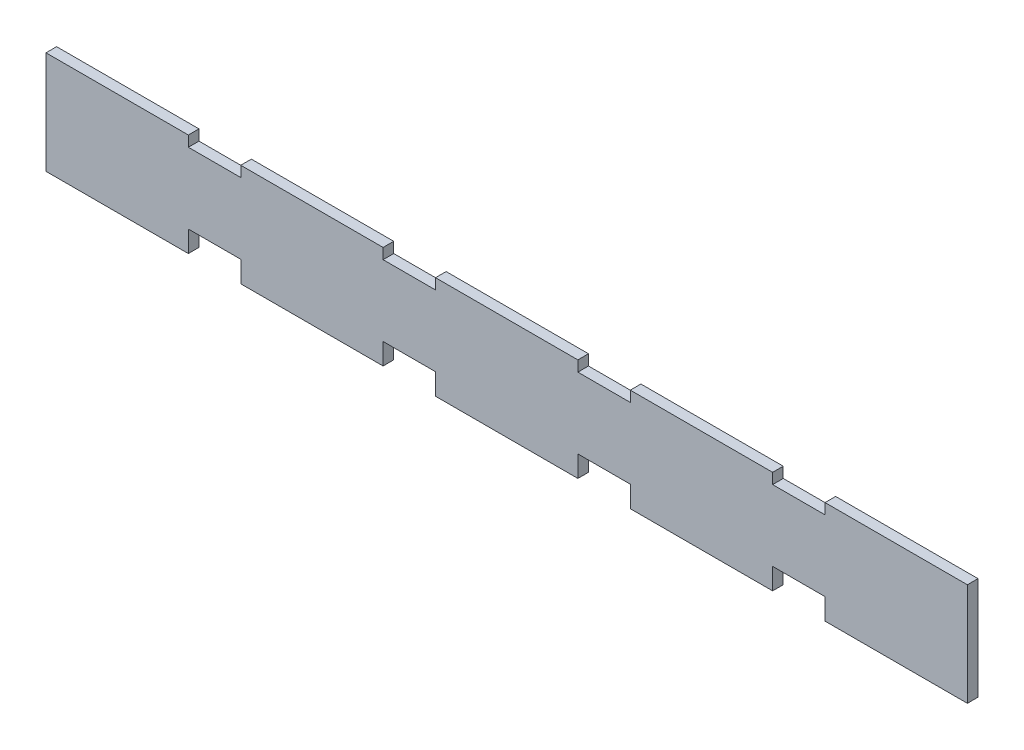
ISO-10303-21;
HEADER;
FILE_DESCRIPTION(('STEP AP214'),'2;1');
FILE_NAME('part.step','',(''),(''),'','','');
FILE_SCHEMA(('AUTOMOTIVE_DESIGN { 1 0 10303 214 1 1 1 1 }'));
ENDSEC;
DATA;
#1=APPLICATION_CONTEXT('core data for automotive mechanical design processes');
#2=APPLICATION_PROTOCOL_DEFINITION('international standard','automotive_design',2000,#1);
#3=PRODUCT_CONTEXT('',#1,'mechanical');
#4=PRODUCT('Part','Part','',(#3));
#5=PRODUCT_RELATED_PRODUCT_CATEGORY('part','',(#4));
#6=PRODUCT_DEFINITION_FORMATION('','',#4);
#7=PRODUCT_DEFINITION_CONTEXT('part definition',#1,'design');
#8=PRODUCT_DEFINITION('design','',#6,#7);
#9=PRODUCT_DEFINITION_SHAPE('','',#8);
#10=(LENGTH_UNIT() NAMED_UNIT(*) SI_UNIT(.MILLI.,.METRE.));
#11=(NAMED_UNIT(*) PLANE_ANGLE_UNIT() SI_UNIT($,.RADIAN.));
#12=(NAMED_UNIT(*) SI_UNIT($,.STERADIAN.) SOLID_ANGLE_UNIT());
#13=UNCERTAINTY_MEASURE_WITH_UNIT(LENGTH_MEASURE(1.E-05),#10,'distance_accuracy_value','');
#14=(GEOMETRIC_REPRESENTATION_CONTEXT(3) GLOBAL_UNCERTAINTY_ASSIGNED_CONTEXT((#13)) GLOBAL_UNIT_ASSIGNED_CONTEXT((#10,
#11,#12)) REPRESENTATION_CONTEXT('',''));
#15=CARTESIAN_POINT('',(0.,0.,0.));
#16=DIRECTION('',(0.,0.,1.));
#17=DIRECTION('',(1.,0.,0.));
#18=AXIS2_PLACEMENT_3D('',#15,#16,#17);
#19=CARTESIAN_POINT('',(-130.1,-10.,3.));
#20=DIRECTION('',(1.,0.,0.));
#21=DIRECTION('',(0.,1.,0.));
#22=AXIS2_PLACEMENT_3D('',#19,#20,#21);
#23=PLANE('',#22);
#24=DIRECTION('',(0.,-1.,0.));
#25=VECTOR('',#24,1.);
#26=CARTESIAN_POINT('',(-130.1,-10.,0.));
#27=LINE('',#26,#25);
#28=CARTESIAN_POINT('',(-130.1,13.,0.));
#29=VERTEX_POINT('',#28);
#30=CARTESIAN_POINT('',(-130.1,-16.,0.));
#31=VERTEX_POINT('',#30);
#32=EDGE_CURVE('E182',#29,#31,#27,.T.);
#33=ORIENTED_EDGE('',*,*,#32,.T.);
#34=DIRECTION('',(0.,0.,-1.));
#35=VECTOR('',#34,1.);
#36=CARTESIAN_POINT('',(-130.1,-16.,3.));
#37=LINE('',#36,#35);
#38=CARTESIAN_POINT('',(-130.1,-16.,3.));
#39=VERTEX_POINT('',#38);
#40=EDGE_CURVE('E11',#39,#31,#37,.T.);
#41=ORIENTED_EDGE('',*,*,#40,.F.);
#42=DIRECTION('',(0.,-1.,0.));
#43=VECTOR('',#42,1.);
#44=CARTESIAN_POINT('',(-130.1,9.99999999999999,3.));
#45=LINE('',#44,#43);
#46=CARTESIAN_POINT('',(-130.1,13.,3.));
#47=VERTEX_POINT('',#46);
#48=EDGE_CURVE('E188',#47,#39,#45,.T.);
#49=ORIENTED_EDGE('',*,*,#48,.F.);
#50=DIRECTION('',(0.,0.,-1.));
#51=VECTOR('',#50,1.);
#52=CARTESIAN_POINT('',(-130.1,13.,3.));
#53=LINE('',#52,#51);
#54=EDGE_CURVE('E310',#47,#29,#53,.T.);
#55=ORIENTED_EDGE('',*,*,#54,.T.);
#56=EDGE_LOOP('',(#33,#41,#49,#55));
#57=FACE_BOUND('',#56,.T.);
#58=ADVANCED_FACE('F45',(#57),#23,.F.);
#59=CARTESIAN_POINT('',(-130.1,-16.,3.));
#60=DIRECTION('',(0.,1.,0.));
#61=DIRECTION('',(0.,0.,1.));
#62=AXIS2_PLACEMENT_3D('',#59,#60,#61);
#63=PLANE('',#62);
#64=DIRECTION('',(1.,0.,0.));
#65=VECTOR('',#64,1.);
#66=CARTESIAN_POINT('',(-130.1,-16.,0.));
#67=LINE('',#66,#65);
#68=CARTESIAN_POINT('',(-89.9,-16.,0.));
#69=VERTEX_POINT('',#68);
#70=EDGE_CURVE('E316',#31,#69,#67,.T.);
#71=ORIENTED_EDGE('',*,*,#70,.T.);
#72=DIRECTION('',(0.,0.,-1.));
#73=VECTOR('',#72,1.);
#74=CARTESIAN_POINT('',(-89.9,-16.,3.));
#75=LINE('',#74,#73);
#76=CARTESIAN_POINT('',(-89.9,-16.,3.));
#77=VERTEX_POINT('',#76);
#78=EDGE_CURVE('E54',#77,#69,#75,.T.);
#79=ORIENTED_EDGE('',*,*,#78,.F.);
#80=DIRECTION('',(1.,0.,0.));
#81=VECTOR('',#80,1.);
#82=CARTESIAN_POINT('',(-130.1,-16.,3.));
#83=LINE('',#82,#81);
#84=EDGE_CURVE('E673',#39,#77,#83,.T.);
#85=ORIENTED_EDGE('',*,*,#84,.F.);
#86=ORIENTED_EDGE('',*,*,#40,.T.);
#87=EDGE_LOOP('',(#71,#79,#85,#86));
#88=FACE_BOUND('',#87,.T.);
#89=ADVANCED_FACE('F678',(#88),#63,.F.);
#90=CARTESIAN_POINT('',(-89.9,-10.,3.));
#91=DIRECTION('',(-1.,0.,0.));
#92=DIRECTION('',(0.,0.,1.));
#93=AXIS2_PLACEMENT_3D('',#90,#91,#92);
#94=PLANE('',#93);
#95=DIRECTION('',(0.,1.,0.));
#96=VECTOR('',#95,1.);
#97=CARTESIAN_POINT('',(-89.9,-10.,0.));
#98=LINE('',#97,#96);
#99=CARTESIAN_POINT('',(-89.9,-10.,0.));
#100=VERTEX_POINT('',#99);
#101=EDGE_CURVE('E319',#69,#100,#98,.T.);
#102=ORIENTED_EDGE('',*,*,#101,.T.);
#103=DIRECTION('',(0.,0.,-1.));
#104=VECTOR('',#103,1.);
#105=CARTESIAN_POINT('',(-89.9,-10.,3.));
#106=LINE('',#105,#104);
#107=CARTESIAN_POINT('',(-89.9,-10.,3.));
#108=VERTEX_POINT('',#107);
#109=EDGE_CURVE('E543',#108,#100,#106,.T.);
#110=ORIENTED_EDGE('',*,*,#109,.F.);
#111=DIRECTION('',(0.,1.,0.));
#112=VECTOR('',#111,1.);
#113=CARTESIAN_POINT('',(-89.9,-10.,3.));
#114=LINE('',#113,#112);
#115=EDGE_CURVE('E554',#77,#108,#114,.T.);
#116=ORIENTED_EDGE('',*,*,#115,.F.);
#117=ORIENTED_EDGE('',*,*,#78,.T.);
#118=EDGE_LOOP('',(#102,#110,#116,#117));
#119=FACE_BOUND('',#118,.T.);
#120=ADVANCED_FACE('F552',(#119),#94,.F.);
#121=CARTESIAN_POINT('',(-75.1,-10.,3.));
#122=DIRECTION('',(0.,1.,0.));
#123=DIRECTION('',(-1.,0.,0.));
#124=AXIS2_PLACEMENT_3D('',#121,#122,#123);
#125=PLANE('',#124);
#126=DIRECTION('',(1.,0.,0.));
#127=VECTOR('',#126,1.);
#128=CARTESIAN_POINT('',(-75.1,-10.,0.));
#129=LINE('',#128,#127);
#130=CARTESIAN_POINT('',(-75.1,-10.,0.));
#131=VERTEX_POINT('',#130);
#132=EDGE_CURVE('E322',#100,#131,#129,.T.);
#133=ORIENTED_EDGE('',*,*,#132,.T.);
#134=DIRECTION('',(0.,0.,-1.));
#135=VECTOR('',#134,1.);
#136=CARTESIAN_POINT('',(-75.1,-10.,3.));
#137=LINE('',#136,#135);
#138=CARTESIAN_POINT('',(-75.1,-10.,3.));
#139=VERTEX_POINT('',#138);
#140=EDGE_CURVE('E539',#139,#131,#137,.T.);
#141=ORIENTED_EDGE('',*,*,#140,.F.);
#142=DIRECTION('',(1.,0.,0.));
#143=VECTOR('',#142,1.);
#144=CARTESIAN_POINT('',(-75.1,-10.,3.));
#145=LINE('',#144,#143);
#146=EDGE_CURVE('E573',#108,#139,#145,.T.);
#147=ORIENTED_EDGE('',*,*,#146,.F.);
#148=ORIENTED_EDGE('',*,*,#109,.T.);
#149=EDGE_LOOP('',(#133,#141,#147,#148));
#150=FACE_BOUND('',#149,.T.);
#151=ADVANCED_FACE('F563',(#150),#125,.F.);
#152=CARTESIAN_POINT('',(-75.1,-10.,3.));
#153=DIRECTION('',(1.,0.,0.));
#154=DIRECTION('',(0.,0.,-1.));
#155=AXIS2_PLACEMENT_3D('',#152,#153,#154);
#156=PLANE('',#155);
#157=DIRECTION('',(0.,-1.,0.));
#158=VECTOR('',#157,1.);
#159=CARTESIAN_POINT('',(-75.1,-10.,0.));
#160=LINE('',#159,#158);
#161=CARTESIAN_POINT('',(-75.1,-16.,0.));
#162=VERTEX_POINT('',#161);
#163=EDGE_CURVE('E325',#131,#162,#160,.T.);
#164=ORIENTED_EDGE('',*,*,#163,.T.);
#165=DIRECTION('',(0.,0.,-1.));
#166=VECTOR('',#165,1.);
#167=CARTESIAN_POINT('',(-75.1,-16.,3.));
#168=LINE('',#167,#166);
#169=CARTESIAN_POINT('',(-75.1,-16.,3.));
#170=VERTEX_POINT('',#169);
#171=EDGE_CURVE('E535',#170,#162,#168,.T.);
#172=ORIENTED_EDGE('',*,*,#171,.F.);
#173=DIRECTION('',(0.,-1.,0.));
#174=VECTOR('',#173,1.);
#175=CARTESIAN_POINT('',(-75.1,-10.,3.));
#176=LINE('',#175,#174);
#177=EDGE_CURVE('E569',#139,#170,#176,.T.);
#178=ORIENTED_EDGE('',*,*,#177,.F.);
#179=ORIENTED_EDGE('',*,*,#140,.T.);
#180=EDGE_LOOP('',(#164,#172,#178,#179));
#181=FACE_BOUND('',#180,.T.);
#182=ADVANCED_FACE('F567',(#181),#156,.F.);
#183=CARTESIAN_POINT('',(-75.1,-16.,3.));
#184=DIRECTION('',(0.,1.,0.));
#185=DIRECTION('',(0.,0.,1.));
#186=AXIS2_PLACEMENT_3D('',#183,#184,#185);
#187=PLANE('',#186);
#188=DIRECTION('',(1.,0.,0.));
#189=VECTOR('',#188,1.);
#190=CARTESIAN_POINT('',(-75.1,-16.,0.));
#191=LINE('',#190,#189);
#192=CARTESIAN_POINT('',(-34.9,-16.,0.));
#193=VERTEX_POINT('',#192);
#194=EDGE_CURVE('E328',#162,#193,#191,.T.);
#195=ORIENTED_EDGE('',*,*,#194,.T.);
#196=DIRECTION('',(0.,0.,-1.));
#197=VECTOR('',#196,1.);
#198=CARTESIAN_POINT('',(-34.9,-16.,3.));
#199=LINE('',#198,#197);
#200=CARTESIAN_POINT('',(-34.9,-16.,3.));
#201=VERTEX_POINT('',#200);
#202=EDGE_CURVE('E531',#201,#193,#199,.T.);
#203=ORIENTED_EDGE('',*,*,#202,.F.);
#204=DIRECTION('',(1.,0.,0.));
#205=VECTOR('',#204,1.);
#206=CARTESIAN_POINT('',(-75.1,-16.,3.));
#207=LINE('',#206,#205);
#208=EDGE_CURVE('E572',#170,#201,#207,.T.);
#209=ORIENTED_EDGE('',*,*,#208,.F.);
#210=ORIENTED_EDGE('',*,*,#171,.T.);
#211=EDGE_LOOP('',(#195,#203,#209,#210));
#212=FACE_BOUND('',#211,.T.);
#213=ADVANCED_FACE('F690',(#212),#187,.F.);
#214=CARTESIAN_POINT('',(-34.9,-10.,3.));
#215=DIRECTION('',(-1.,0.,0.));
#216=DIRECTION('',(0.,0.,1.));
#217=AXIS2_PLACEMENT_3D('',#214,#215,#216);
#218=PLANE('',#217);
#219=DIRECTION('',(0.,1.,0.));
#220=VECTOR('',#219,1.);
#221=CARTESIAN_POINT('',(-34.9,-10.,0.));
#222=LINE('',#221,#220);
#223=CARTESIAN_POINT('',(-34.9,-10.,0.));
#224=VERTEX_POINT('',#223);
#225=EDGE_CURVE('E331',#193,#224,#222,.T.);
#226=ORIENTED_EDGE('',*,*,#225,.T.);
#227=DIRECTION('',(0.,0.,-1.));
#228=VECTOR('',#227,1.);
#229=CARTESIAN_POINT('',(-34.9,-10.,3.));
#230=LINE('',#229,#228);
#231=CARTESIAN_POINT('',(-34.9,-10.,3.));
#232=VERTEX_POINT('',#231);
#233=EDGE_CURVE('E527',#232,#224,#230,.T.);
#234=ORIENTED_EDGE('',*,*,#233,.F.);
#235=DIRECTION('',(0.,1.,0.));
#236=VECTOR('',#235,1.);
#237=CARTESIAN_POINT('',(-34.9,-10.,3.));
#238=LINE('',#237,#236);
#239=EDGE_CURVE('E577',#201,#232,#238,.T.);
#240=ORIENTED_EDGE('',*,*,#239,.F.);
#241=ORIENTED_EDGE('',*,*,#202,.T.);
#242=EDGE_LOOP('',(#226,#234,#240,#241));
#243=FACE_BOUND('',#242,.T.);
#244=ADVANCED_FACE('F693',(#243),#218,.F.);
#245=CARTESIAN_POINT('',(-20.1,-10.,3.));
#246=DIRECTION('',(0.,1.,0.));
#247=DIRECTION('',(-1.,0.,0.));
#248=AXIS2_PLACEMENT_3D('',#245,#246,#247);
#249=PLANE('',#248);
#250=DIRECTION('',(1.,0.,0.));
#251=VECTOR('',#250,1.);
#252=CARTESIAN_POINT('',(-20.1,-10.,0.));
#253=LINE('',#252,#251);
#254=CARTESIAN_POINT('',(-20.1,-10.,0.));
#255=VERTEX_POINT('',#254);
#256=EDGE_CURVE('E334',#224,#255,#253,.T.);
#257=ORIENTED_EDGE('',*,*,#256,.T.);
#258=DIRECTION('',(0.,0.,-1.));
#259=VECTOR('',#258,1.);
#260=CARTESIAN_POINT('',(-20.1,-10.,3.));
#261=LINE('',#260,#259);
#262=CARTESIAN_POINT('',(-20.1,-10.,3.));
#263=VERTEX_POINT('',#262);
#264=EDGE_CURVE('E523',#263,#255,#261,.T.);
#265=ORIENTED_EDGE('',*,*,#264,.F.);
#266=DIRECTION('',(1.,0.,0.));
#267=VECTOR('',#266,1.);
#268=CARTESIAN_POINT('',(-20.1,-10.,3.));
#269=LINE('',#268,#267);
#270=EDGE_CURVE('E584',#232,#263,#269,.T.);
#271=ORIENTED_EDGE('',*,*,#270,.F.);
#272=ORIENTED_EDGE('',*,*,#233,.T.);
#273=EDGE_LOOP('',(#257,#265,#271,#272));
#274=FACE_BOUND('',#273,.T.);
#275=ADVANCED_FACE('F697',(#274),#249,.F.);
#276=CARTESIAN_POINT('',(-20.1,-10.,3.));
#277=DIRECTION('',(1.,0.,0.));
#278=DIRECTION('',(0.,0.,-1.));
#279=AXIS2_PLACEMENT_3D('',#276,#277,#278);
#280=PLANE('',#279);
#281=DIRECTION('',(0.,-1.,0.));
#282=VECTOR('',#281,1.);
#283=CARTESIAN_POINT('',(-20.1,-10.,0.));
#284=LINE('',#283,#282);
#285=CARTESIAN_POINT('',(-20.1,-16.,0.));
#286=VERTEX_POINT('',#285);
#287=EDGE_CURVE('E337',#255,#286,#284,.T.);
#288=ORIENTED_EDGE('',*,*,#287,.T.);
#289=DIRECTION('',(0.,0.,-1.));
#290=VECTOR('',#289,1.);
#291=CARTESIAN_POINT('',(-20.1,-16.,3.));
#292=LINE('',#291,#290);
#293=CARTESIAN_POINT('',(-20.1,-16.,3.));
#294=VERTEX_POINT('',#293);
#295=EDGE_CURVE('E519',#294,#286,#292,.T.);
#296=ORIENTED_EDGE('',*,*,#295,.F.);
#297=DIRECTION('',(0.,-1.,0.));
#298=VECTOR('',#297,1.);
#299=CARTESIAN_POINT('',(-20.1,-10.,3.));
#300=LINE('',#299,#298);
#301=EDGE_CURVE('E587',#263,#294,#300,.T.);
#302=ORIENTED_EDGE('',*,*,#301,.F.);
#303=ORIENTED_EDGE('',*,*,#264,.T.);
#304=EDGE_LOOP('',(#288,#296,#302,#303));
#305=FACE_BOUND('',#304,.T.);
#306=ADVANCED_FACE('F701',(#305),#280,.F.);
#307=CARTESIAN_POINT('',(-20.1,-16.,3.));
#308=DIRECTION('',(0.,1.,0.));
#309=DIRECTION('',(0.,0.,1.));
#310=AXIS2_PLACEMENT_3D('',#307,#308,#309);
#311=PLANE('',#310);
#312=DIRECTION('',(1.,0.,0.));
#313=VECTOR('',#312,1.);
#314=CARTESIAN_POINT('',(-20.1,-16.,0.));
#315=LINE('',#314,#313);
#316=CARTESIAN_POINT('',(20.1,-16.,0.));
#317=VERTEX_POINT('',#316);
#318=EDGE_CURVE('E340',#286,#317,#315,.T.);
#319=ORIENTED_EDGE('',*,*,#318,.T.);
#320=DIRECTION('',(0.,0.,-1.));
#321=VECTOR('',#320,1.);
#322=CARTESIAN_POINT('',(20.1,-16.,3.));
#323=LINE('',#322,#321);
#324=CARTESIAN_POINT('',(20.1,-16.,3.));
#325=VERTEX_POINT('',#324);
#326=EDGE_CURVE('E515',#325,#317,#323,.T.);
#327=ORIENTED_EDGE('',*,*,#326,.F.);
#328=DIRECTION('',(1.,0.,0.));
#329=VECTOR('',#328,1.);
#330=CARTESIAN_POINT('',(-20.1,-16.,3.));
#331=LINE('',#330,#329);
#332=EDGE_CURVE('E590',#294,#325,#331,.T.);
#333=ORIENTED_EDGE('',*,*,#332,.F.);
#334=ORIENTED_EDGE('',*,*,#295,.T.);
#335=EDGE_LOOP('',(#319,#327,#333,#334));
#336=FACE_BOUND('',#335,.T.);
#337=ADVANCED_FACE('F705',(#336),#311,.F.);
#338=CARTESIAN_POINT('',(20.1,-10.,3.));
#339=DIRECTION('',(-1.,0.,0.));
#340=DIRECTION('',(0.,0.,1.));
#341=AXIS2_PLACEMENT_3D('',#338,#339,#340);
#342=PLANE('',#341);
#343=DIRECTION('',(0.,1.,0.));
#344=VECTOR('',#343,1.);
#345=CARTESIAN_POINT('',(20.1,-10.,0.));
#346=LINE('',#345,#344);
#347=CARTESIAN_POINT('',(20.1,-10.,0.));
#348=VERTEX_POINT('',#347);
#349=EDGE_CURVE('E343',#317,#348,#346,.T.);
#350=ORIENTED_EDGE('',*,*,#349,.T.);
#351=DIRECTION('',(0.,0.,-1.));
#352=VECTOR('',#351,1.);
#353=CARTESIAN_POINT('',(20.1,-10.,3.));
#354=LINE('',#353,#352);
#355=CARTESIAN_POINT('',(20.1,-10.,3.));
#356=VERTEX_POINT('',#355);
#357=EDGE_CURVE('E511',#356,#348,#354,.T.);
#358=ORIENTED_EDGE('',*,*,#357,.F.);
#359=DIRECTION('',(0.,1.,0.));
#360=VECTOR('',#359,1.);
#361=CARTESIAN_POINT('',(20.1,-10.,3.));
#362=LINE('',#361,#360);
#363=EDGE_CURVE('E593',#325,#356,#362,.T.);
#364=ORIENTED_EDGE('',*,*,#363,.F.);
#365=ORIENTED_EDGE('',*,*,#326,.T.);
#366=EDGE_LOOP('',(#350,#358,#364,#365));
#367=FACE_BOUND('',#366,.T.);
#368=ADVANCED_FACE('F709',(#367),#342,.F.);
#369=CARTESIAN_POINT('',(34.9,-10.,3.));
#370=DIRECTION('',(0.,1.,0.));
#371=DIRECTION('',(-1.,0.,0.));
#372=AXIS2_PLACEMENT_3D('',#369,#370,#371);
#373=PLANE('',#372);
#374=DIRECTION('',(1.,0.,0.));
#375=VECTOR('',#374,1.);
#376=CARTESIAN_POINT('',(34.9,-10.,0.));
#377=LINE('',#376,#375);
#378=CARTESIAN_POINT('',(34.9,-10.,0.));
#379=VERTEX_POINT('',#378);
#380=EDGE_CURVE('E346',#348,#379,#377,.T.);
#381=ORIENTED_EDGE('',*,*,#380,.T.);
#382=DIRECTION('',(0.,0.,-1.));
#383=VECTOR('',#382,1.);
#384=CARTESIAN_POINT('',(34.9,-10.,3.));
#385=LINE('',#384,#383);
#386=CARTESIAN_POINT('',(34.9,-10.,3.));
#387=VERTEX_POINT('',#386);
#388=EDGE_CURVE('E507',#387,#379,#385,.T.);
#389=ORIENTED_EDGE('',*,*,#388,.F.);
#390=DIRECTION('',(1.,0.,0.));
#391=VECTOR('',#390,1.);
#392=CARTESIAN_POINT('',(34.9,-10.,3.));
#393=LINE('',#392,#391);
#394=EDGE_CURVE('E596',#356,#387,#393,.T.);
#395=ORIENTED_EDGE('',*,*,#394,.F.);
#396=ORIENTED_EDGE('',*,*,#357,.T.);
#397=EDGE_LOOP('',(#381,#389,#395,#396));
#398=FACE_BOUND('',#397,.T.);
#399=ADVANCED_FACE('F713',(#398),#373,.F.);
#400=CARTESIAN_POINT('',(34.9,-10.,3.));
#401=DIRECTION('',(1.,0.,0.));
#402=DIRECTION('',(0.,0.,-1.));
#403=AXIS2_PLACEMENT_3D('',#400,#401,#402);
#404=PLANE('',#403);
#405=DIRECTION('',(0.,-1.,0.));
#406=VECTOR('',#405,1.);
#407=CARTESIAN_POINT('',(34.9,-10.,0.));
#408=LINE('',#407,#406);
#409=CARTESIAN_POINT('',(34.9,-16.,0.));
#410=VERTEX_POINT('',#409);
#411=EDGE_CURVE('E349',#379,#410,#408,.T.);
#412=ORIENTED_EDGE('',*,*,#411,.T.);
#413=DIRECTION('',(0.,0.,-1.));
#414=VECTOR('',#413,1.);
#415=CARTESIAN_POINT('',(34.9,-16.,3.));
#416=LINE('',#415,#414);
#417=CARTESIAN_POINT('',(34.9,-16.,3.));
#418=VERTEX_POINT('',#417);
#419=EDGE_CURVE('E503',#418,#410,#416,.T.);
#420=ORIENTED_EDGE('',*,*,#419,.F.);
#421=DIRECTION('',(0.,-1.,0.));
#422=VECTOR('',#421,1.);
#423=CARTESIAN_POINT('',(34.9,-10.,3.));
#424=LINE('',#423,#422);
#425=EDGE_CURVE('E599',#387,#418,#424,.T.);
#426=ORIENTED_EDGE('',*,*,#425,.F.);
#427=ORIENTED_EDGE('',*,*,#388,.T.);
#428=EDGE_LOOP('',(#412,#420,#426,#427));
#429=FACE_BOUND('',#428,.T.);
#430=ADVANCED_FACE('F717',(#429),#404,.F.);
#431=CARTESIAN_POINT('',(34.9,-16.,3.));
#432=DIRECTION('',(0.,1.,0.));
#433=DIRECTION('',(0.,0.,1.));
#434=AXIS2_PLACEMENT_3D('',#431,#432,#433);
#435=PLANE('',#434);
#436=DIRECTION('',(1.,0.,0.));
#437=VECTOR('',#436,1.);
#438=CARTESIAN_POINT('',(34.9,-16.,0.));
#439=LINE('',#438,#437);
#440=CARTESIAN_POINT('',(75.1,-16.,0.));
#441=VERTEX_POINT('',#440);
#442=EDGE_CURVE('E352',#410,#441,#439,.T.);
#443=ORIENTED_EDGE('',*,*,#442,.T.);
#444=DIRECTION('',(0.,0.,-1.));
#445=VECTOR('',#444,1.);
#446=CARTESIAN_POINT('',(75.1,-16.,3.));
#447=LINE('',#446,#445);
#448=CARTESIAN_POINT('',(75.1,-16.,3.));
#449=VERTEX_POINT('',#448);
#450=EDGE_CURVE('E499',#449,#441,#447,.T.);
#451=ORIENTED_EDGE('',*,*,#450,.F.);
#452=DIRECTION('',(1.,0.,0.));
#453=VECTOR('',#452,1.);
#454=CARTESIAN_POINT('',(34.9,-16.,3.));
#455=LINE('',#454,#453);
#456=EDGE_CURVE('E602',#418,#449,#455,.T.);
#457=ORIENTED_EDGE('',*,*,#456,.F.);
#458=ORIENTED_EDGE('',*,*,#419,.T.);
#459=EDGE_LOOP('',(#443,#451,#457,#458));
#460=FACE_BOUND('',#459,.T.);
#461=ADVANCED_FACE('F721',(#460),#435,.F.);
#462=CARTESIAN_POINT('',(75.1,-10.,3.));
#463=DIRECTION('',(-1.,0.,0.));
#464=DIRECTION('',(0.,0.,1.));
#465=AXIS2_PLACEMENT_3D('',#462,#463,#464);
#466=PLANE('',#465);
#467=DIRECTION('',(0.,1.,0.));
#468=VECTOR('',#467,1.);
#469=CARTESIAN_POINT('',(75.1,-10.,0.));
#470=LINE('',#469,#468);
#471=CARTESIAN_POINT('',(75.1,-10.,0.));
#472=VERTEX_POINT('',#471);
#473=EDGE_CURVE('E355',#441,#472,#470,.T.);
#474=ORIENTED_EDGE('',*,*,#473,.T.);
#475=DIRECTION('',(0.,0.,-1.));
#476=VECTOR('',#475,1.);
#477=CARTESIAN_POINT('',(75.1,-10.,3.));
#478=LINE('',#477,#476);
#479=CARTESIAN_POINT('',(75.1,-10.,3.));
#480=VERTEX_POINT('',#479);
#481=EDGE_CURVE('E495',#480,#472,#478,.T.);
#482=ORIENTED_EDGE('',*,*,#481,.F.);
#483=DIRECTION('',(0.,1.,0.));
#484=VECTOR('',#483,1.);
#485=CARTESIAN_POINT('',(75.1,-10.,3.));
#486=LINE('',#485,#484);
#487=EDGE_CURVE('E605',#449,#480,#486,.T.);
#488=ORIENTED_EDGE('',*,*,#487,.F.);
#489=ORIENTED_EDGE('',*,*,#450,.T.);
#490=EDGE_LOOP('',(#474,#482,#488,#489));
#491=FACE_BOUND('',#490,.T.);
#492=ADVANCED_FACE('F725',(#491),#466,.F.);
#493=CARTESIAN_POINT('',(89.9,-10.,3.));
#494=DIRECTION('',(0.,1.,0.));
#495=DIRECTION('',(-1.,0.,0.));
#496=AXIS2_PLACEMENT_3D('',#493,#494,#495);
#497=PLANE('',#496);
#498=DIRECTION('',(1.,0.,0.));
#499=VECTOR('',#498,1.);
#500=CARTESIAN_POINT('',(89.9,-10.,0.));
#501=LINE('',#500,#499);
#502=CARTESIAN_POINT('',(89.9,-10.,0.));
#503=VERTEX_POINT('',#502);
#504=EDGE_CURVE('E358',#472,#503,#501,.T.);
#505=ORIENTED_EDGE('',*,*,#504,.T.);
#506=DIRECTION('',(0.,0.,-1.));
#507=VECTOR('',#506,1.);
#508=CARTESIAN_POINT('',(89.9,-10.,3.));
#509=LINE('',#508,#507);
#510=CARTESIAN_POINT('',(89.9,-10.,3.));
#511=VERTEX_POINT('',#510);
#512=EDGE_CURVE('E491',#511,#503,#509,.T.);
#513=ORIENTED_EDGE('',*,*,#512,.F.);
#514=DIRECTION('',(1.,0.,0.));
#515=VECTOR('',#514,1.);
#516=CARTESIAN_POINT('',(89.9,-10.,3.));
#517=LINE('',#516,#515);
#518=EDGE_CURVE('E608',#480,#511,#517,.T.);
#519=ORIENTED_EDGE('',*,*,#518,.F.);
#520=ORIENTED_EDGE('',*,*,#481,.T.);
#521=EDGE_LOOP('',(#505,#513,#519,#520));
#522=FACE_BOUND('',#521,.T.);
#523=ADVANCED_FACE('F729',(#522),#497,.F.);
#524=CARTESIAN_POINT('',(89.9,-10.,3.));
#525=DIRECTION('',(1.,0.,0.));
#526=DIRECTION('',(0.,0.,-1.));
#527=AXIS2_PLACEMENT_3D('',#524,#525,#526);
#528=PLANE('',#527);
#529=DIRECTION('',(0.,-1.,0.));
#530=VECTOR('',#529,1.);
#531=CARTESIAN_POINT('',(89.9,-10.,0.));
#532=LINE('',#531,#530);
#533=CARTESIAN_POINT('',(89.9,-16.,0.));
#534=VERTEX_POINT('',#533);
#535=EDGE_CURVE('E361',#503,#534,#532,.T.);
#536=ORIENTED_EDGE('',*,*,#535,.T.);
#537=DIRECTION('',(0.,0.,-1.));
#538=VECTOR('',#537,1.);
#539=CARTESIAN_POINT('',(89.9,-16.,3.));
#540=LINE('',#539,#538);
#541=CARTESIAN_POINT('',(89.9,-16.,3.));
#542=VERTEX_POINT('',#541);
#543=EDGE_CURVE('E487',#542,#534,#540,.T.);
#544=ORIENTED_EDGE('',*,*,#543,.F.);
#545=DIRECTION('',(0.,-1.,0.));
#546=VECTOR('',#545,1.);
#547=CARTESIAN_POINT('',(89.9,-10.,3.));
#548=LINE('',#547,#546);
#549=EDGE_CURVE('E611',#511,#542,#548,.T.);
#550=ORIENTED_EDGE('',*,*,#549,.F.);
#551=ORIENTED_EDGE('',*,*,#512,.T.);
#552=EDGE_LOOP('',(#536,#544,#550,#551));
#553=FACE_BOUND('',#552,.T.);
#554=ADVANCED_FACE('F733',(#553),#528,.F.);
#555=CARTESIAN_POINT('',(89.9,-16.,3.));
#556=DIRECTION('',(0.,1.,0.));
#557=DIRECTION('',(0.,0.,1.));
#558=AXIS2_PLACEMENT_3D('',#555,#556,#557);
#559=PLANE('',#558);
#560=DIRECTION('',(1.,0.,0.));
#561=VECTOR('',#560,1.);
#562=CARTESIAN_POINT('',(89.9,-16.,0.));
#563=LINE('',#562,#561);
#564=CARTESIAN_POINT('',(130.1,-16.,0.));
#565=VERTEX_POINT('',#564);
#566=EDGE_CURVE('E364',#534,#565,#563,.T.);
#567=ORIENTED_EDGE('',*,*,#566,.T.);
#568=DIRECTION('',(0.,0.,-1.));
#569=VECTOR('',#568,1.);
#570=CARTESIAN_POINT('',(130.1,-16.,3.));
#571=LINE('',#570,#569);
#572=CARTESIAN_POINT('',(130.1,-16.,3.));
#573=VERTEX_POINT('',#572);
#574=EDGE_CURVE('E483',#573,#565,#571,.T.);
#575=ORIENTED_EDGE('',*,*,#574,.F.);
#576=DIRECTION('',(1.,0.,0.));
#577=VECTOR('',#576,1.);
#578=CARTESIAN_POINT('',(89.9,-16.,3.));
#579=LINE('',#578,#577);
#580=EDGE_CURVE('E614',#542,#573,#579,.T.);
#581=ORIENTED_EDGE('',*,*,#580,.F.);
#582=ORIENTED_EDGE('',*,*,#543,.T.);
#583=EDGE_LOOP('',(#567,#575,#581,#582));
#584=FACE_BOUND('',#583,.T.);
#585=ADVANCED_FACE('F737',(#584),#559,.F.);
#586=CARTESIAN_POINT('',(130.1,10.,3.));
#587=DIRECTION('',(-1.,0.,0.));
#588=DIRECTION('',(0.,0.,1.));
#589=AXIS2_PLACEMENT_3D('',#586,#587,#588);
#590=PLANE('',#589);
#591=DIRECTION('',(0.,1.,0.));
#592=VECTOR('',#591,1.);
#593=CARTESIAN_POINT('',(130.1,10.,0.));
#594=LINE('',#593,#592);
#595=CARTESIAN_POINT('',(130.1,13.,0.));
#596=VERTEX_POINT('',#595);
#597=EDGE_CURVE('E368',#565,#596,#594,.T.);
#598=ORIENTED_EDGE('',*,*,#597,.T.);
#599=DIRECTION('',(0.,0.,-1.));
#600=VECTOR('',#599,1.);
#601=CARTESIAN_POINT('',(130.1,13.,3.));
#602=LINE('',#601,#600);
#603=CARTESIAN_POINT('',(130.1,13.,3.));
#604=VERTEX_POINT('',#603);
#605=EDGE_CURVE('E479',#604,#596,#602,.T.);
#606=ORIENTED_EDGE('',*,*,#605,.F.);
#607=DIRECTION('',(0.,1.,0.));
#608=VECTOR('',#607,1.);
#609=CARTESIAN_POINT('',(130.1,-10.,3.));
#610=LINE('',#609,#608);
#611=EDGE_CURVE('E617',#573,#604,#610,.T.);
#612=ORIENTED_EDGE('',*,*,#611,.F.);
#613=ORIENTED_EDGE('',*,*,#574,.T.);
#614=EDGE_LOOP('',(#598,#606,#612,#613));
#615=FACE_BOUND('',#614,.T.);
#616=ADVANCED_FACE('F741',(#615),#590,.F.);
#617=CARTESIAN_POINT('',(89.9,13.,3.));
#618=DIRECTION('',(0.,-1.,0.));
#619=DIRECTION('',(1.,0.,0.));
#620=AXIS2_PLACEMENT_3D('',#617,#618,#619);
#621=PLANE('',#620);
#622=DIRECTION('',(-1.,0.,0.));
#623=VECTOR('',#622,1.);
#624=CARTESIAN_POINT('',(89.9,13.,0.));
#625=LINE('',#624,#623);
#626=CARTESIAN_POINT('',(89.9,13.,0.));
#627=VERTEX_POINT('',#626);
#628=EDGE_CURVE('E371',#596,#627,#625,.T.);
#629=ORIENTED_EDGE('',*,*,#628,.T.);
#630=DIRECTION('',(0.,0.,-1.));
#631=VECTOR('',#630,1.);
#632=CARTESIAN_POINT('',(89.9,13.,3.));
#633=LINE('',#632,#631);
#634=CARTESIAN_POINT('',(89.9,13.,3.));
#635=VERTEX_POINT('',#634);
#636=EDGE_CURVE('E475',#635,#627,#633,.T.);
#637=ORIENTED_EDGE('',*,*,#636,.F.);
#638=DIRECTION('',(-1.,0.,0.));
#639=VECTOR('',#638,1.);
#640=CARTESIAN_POINT('',(89.9,13.,3.));
#641=LINE('',#640,#639);
#642=EDGE_CURVE('E620',#604,#635,#641,.T.);
#643=ORIENTED_EDGE('',*,*,#642,.F.);
#644=ORIENTED_EDGE('',*,*,#605,.T.);
#645=EDGE_LOOP('',(#629,#637,#643,#644));
#646=FACE_BOUND('',#645,.T.);
#647=ADVANCED_FACE('F745',(#646),#621,.F.);
#648=CARTESIAN_POINT('',(89.8999999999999,10.,3.));
#649=DIRECTION('',(1.,0.,0.));
#650=DIRECTION('',(0.,1.,0.));
#651=AXIS2_PLACEMENT_3D('',#648,#649,#650);
#652=PLANE('',#651);
#653=DIRECTION('',(0.,-1.,0.));
#654=VECTOR('',#653,1.);
#655=CARTESIAN_POINT('',(89.8999999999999,10.,0.));
#656=LINE('',#655,#654);
#657=CARTESIAN_POINT('',(89.8999999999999,10.,0.));
#658=VERTEX_POINT('',#657);
#659=EDGE_CURVE('E374',#627,#658,#656,.T.);
#660=ORIENTED_EDGE('',*,*,#659,.T.);
#661=DIRECTION('',(0.,0.,-1.));
#662=VECTOR('',#661,1.);
#663=CARTESIAN_POINT('',(89.8999999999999,10.,3.));
#664=LINE('',#663,#662);
#665=CARTESIAN_POINT('',(89.8999999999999,10.,3.));
#666=VERTEX_POINT('',#665);
#667=EDGE_CURVE('E471',#666,#658,#664,.T.);
#668=ORIENTED_EDGE('',*,*,#667,.F.);
#669=DIRECTION('',(0.,-1.,0.));
#670=VECTOR('',#669,1.);
#671=CARTESIAN_POINT('',(89.8999999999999,10.,3.));
#672=LINE('',#671,#670);
#673=EDGE_CURVE('E623',#635,#666,#672,.T.);
#674=ORIENTED_EDGE('',*,*,#673,.F.);
#675=ORIENTED_EDGE('',*,*,#636,.T.);
#676=EDGE_LOOP('',(#660,#668,#674,#675));
#677=FACE_BOUND('',#676,.T.);
#678=ADVANCED_FACE('F749',(#677),#652,.F.);
#679=CARTESIAN_POINT('',(89.8999999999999,10.,3.));
#680=DIRECTION('',(0.,-1.,0.));
#681=DIRECTION('',(1.,0.,0.));
#682=AXIS2_PLACEMENT_3D('',#679,#680,#681);
#683=PLANE('',#682);
#684=DIRECTION('',(-1.,0.,0.));
#685=VECTOR('',#684,1.);
#686=CARTESIAN_POINT('',(89.8999999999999,10.,0.));
#687=LINE('',#686,#685);
#688=CARTESIAN_POINT('',(75.1,10.,0.));
#689=VERTEX_POINT('',#688);
#690=EDGE_CURVE('E377',#658,#689,#687,.T.);
#691=ORIENTED_EDGE('',*,*,#690,.T.);
#692=DIRECTION('',(0.,0.,-1.));
#693=VECTOR('',#692,1.);
#694=CARTESIAN_POINT('',(75.1,10.,3.));
#695=LINE('',#694,#693);
#696=CARTESIAN_POINT('',(75.1,10.,3.));
#697=VERTEX_POINT('',#696);
#698=EDGE_CURVE('E467',#697,#689,#695,.T.);
#699=ORIENTED_EDGE('',*,*,#698,.F.);
#700=DIRECTION('',(-1.,0.,0.));
#701=VECTOR('',#700,1.);
#702=CARTESIAN_POINT('',(89.8999999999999,10.,3.));
#703=LINE('',#702,#701);
#704=EDGE_CURVE('E626',#666,#697,#703,.T.);
#705=ORIENTED_EDGE('',*,*,#704,.F.);
#706=ORIENTED_EDGE('',*,*,#667,.T.);
#707=EDGE_LOOP('',(#691,#699,#705,#706));
#708=FACE_BOUND('',#707,.T.);
#709=ADVANCED_FACE('F753',(#708),#683,.F.);
#710=CARTESIAN_POINT('',(75.1,10.,3.));
#711=DIRECTION('',(-1.,0.,0.));
#712=DIRECTION('',(0.,0.,1.));
#713=AXIS2_PLACEMENT_3D('',#710,#711,#712);
#714=PLANE('',#713);
#715=DIRECTION('',(0.,1.,0.));
#716=VECTOR('',#715,1.);
#717=CARTESIAN_POINT('',(75.1,10.,0.));
#718=LINE('',#717,#716);
#719=CARTESIAN_POINT('',(75.1,13.,0.));
#720=VERTEX_POINT('',#719);
#721=EDGE_CURVE('E380',#689,#720,#718,.T.);
#722=ORIENTED_EDGE('',*,*,#721,.T.);
#723=DIRECTION('',(0.,0.,-1.));
#724=VECTOR('',#723,1.);
#725=CARTESIAN_POINT('',(75.1,13.,3.));
#726=LINE('',#725,#724);
#727=CARTESIAN_POINT('',(75.1,13.,3.));
#728=VERTEX_POINT('',#727);
#729=EDGE_CURVE('E463',#728,#720,#726,.T.);
#730=ORIENTED_EDGE('',*,*,#729,.F.);
#731=DIRECTION('',(0.,1.,0.));
#732=VECTOR('',#731,1.);
#733=CARTESIAN_POINT('',(75.1,10.,3.));
#734=LINE('',#733,#732);
#735=EDGE_CURVE('E629',#697,#728,#734,.T.);
#736=ORIENTED_EDGE('',*,*,#735,.F.);
#737=ORIENTED_EDGE('',*,*,#698,.T.);
#738=EDGE_LOOP('',(#722,#730,#736,#737));
#739=FACE_BOUND('',#738,.T.);
#740=ADVANCED_FACE('F757',(#739),#714,.F.);
#741=CARTESIAN_POINT('',(34.9,13.,3.));
#742=DIRECTION('',(0.,-1.,0.));
#743=DIRECTION('',(0.,0.,-1.));
#744=AXIS2_PLACEMENT_3D('',#741,#742,#743);
#745=PLANE('',#744);
#746=DIRECTION('',(-1.,0.,0.));
#747=VECTOR('',#746,1.);
#748=CARTESIAN_POINT('',(34.9,13.,0.));
#749=LINE('',#748,#747);
#750=CARTESIAN_POINT('',(34.9,13.,0.));
#751=VERTEX_POINT('',#750);
#752=EDGE_CURVE('E383',#720,#751,#749,.T.);
#753=ORIENTED_EDGE('',*,*,#752,.T.);
#754=DIRECTION('',(0.,0.,-1.));
#755=VECTOR('',#754,1.);
#756=CARTESIAN_POINT('',(34.9,13.,3.));
#757=LINE('',#756,#755);
#758=CARTESIAN_POINT('',(34.9,13.,3.));
#759=VERTEX_POINT('',#758);
#760=EDGE_CURVE('E459',#759,#751,#757,.T.);
#761=ORIENTED_EDGE('',*,*,#760,.F.);
#762=DIRECTION('',(-1.,0.,0.));
#763=VECTOR('',#762,1.);
#764=CARTESIAN_POINT('',(34.9,13.,3.));
#765=LINE('',#764,#763);
#766=EDGE_CURVE('E632',#728,#759,#765,.T.);
#767=ORIENTED_EDGE('',*,*,#766,.F.);
#768=ORIENTED_EDGE('',*,*,#729,.T.);
#769=EDGE_LOOP('',(#753,#761,#767,#768));
#770=FACE_BOUND('',#769,.T.);
#771=ADVANCED_FACE('F761',(#770),#745,.F.);
#772=CARTESIAN_POINT('',(34.9,10.,3.));
#773=DIRECTION('',(1.,0.,0.));
#774=DIRECTION('',(0.,1.,0.));
#775=AXIS2_PLACEMENT_3D('',#772,#773,#774);
#776=PLANE('',#775);
#777=DIRECTION('',(0.,-1.,0.));
#778=VECTOR('',#777,1.);
#779=CARTESIAN_POINT('',(34.9,10.,0.));
#780=LINE('',#779,#778);
#781=CARTESIAN_POINT('',(34.9,10.,0.));
#782=VERTEX_POINT('',#781);
#783=EDGE_CURVE('E386',#751,#782,#780,.T.);
#784=ORIENTED_EDGE('',*,*,#783,.T.);
#785=DIRECTION('',(0.,0.,-1.));
#786=VECTOR('',#785,1.);
#787=CARTESIAN_POINT('',(34.9,10.,3.));
#788=LINE('',#787,#786);
#789=CARTESIAN_POINT('',(34.9,10.,3.));
#790=VERTEX_POINT('',#789);
#791=EDGE_CURVE('E455',#790,#782,#788,.T.);
#792=ORIENTED_EDGE('',*,*,#791,.F.);
#793=DIRECTION('',(0.,-1.,0.));
#794=VECTOR('',#793,1.);
#795=CARTESIAN_POINT('',(34.9,10.,3.));
#796=LINE('',#795,#794);
#797=EDGE_CURVE('E635',#759,#790,#796,.T.);
#798=ORIENTED_EDGE('',*,*,#797,.F.);
#799=ORIENTED_EDGE('',*,*,#760,.T.);
#800=EDGE_LOOP('',(#784,#792,#798,#799));
#801=FACE_BOUND('',#800,.T.);
#802=ADVANCED_FACE('F765',(#801),#776,.F.);
#803=CARTESIAN_POINT('',(34.9,10.,3.));
#804=DIRECTION('',(0.,-1.,0.));
#805=DIRECTION('',(1.,0.,0.));
#806=AXIS2_PLACEMENT_3D('',#803,#804,#805);
#807=PLANE('',#806);
#808=DIRECTION('',(-1.,0.,0.));
#809=VECTOR('',#808,1.);
#810=CARTESIAN_POINT('',(34.9,10.,0.));
#811=LINE('',#810,#809);
#812=CARTESIAN_POINT('',(20.1,10.,0.));
#813=VERTEX_POINT('',#812);
#814=EDGE_CURVE('E389',#782,#813,#811,.T.);
#815=ORIENTED_EDGE('',*,*,#814,.T.);
#816=DIRECTION('',(0.,0.,-1.));
#817=VECTOR('',#816,1.);
#818=CARTESIAN_POINT('',(20.1,10.,3.));
#819=LINE('',#818,#817);
#820=CARTESIAN_POINT('',(20.1,10.,3.));
#821=VERTEX_POINT('',#820);
#822=EDGE_CURVE('E451',#821,#813,#819,.T.);
#823=ORIENTED_EDGE('',*,*,#822,.F.);
#824=DIRECTION('',(-1.,0.,0.));
#825=VECTOR('',#824,1.);
#826=CARTESIAN_POINT('',(34.9,10.,3.));
#827=LINE('',#826,#825);
#828=EDGE_CURVE('E638',#790,#821,#827,.T.);
#829=ORIENTED_EDGE('',*,*,#828,.F.);
#830=ORIENTED_EDGE('',*,*,#791,.T.);
#831=EDGE_LOOP('',(#815,#823,#829,#830));
#832=FACE_BOUND('',#831,.T.);
#833=ADVANCED_FACE('F769',(#832),#807,.F.);
#834=CARTESIAN_POINT('',(20.1,10.,3.));
#835=DIRECTION('',(-1.,0.,0.));
#836=DIRECTION('',(0.,0.,1.));
#837=AXIS2_PLACEMENT_3D('',#834,#835,#836);
#838=PLANE('',#837);
#839=DIRECTION('',(0.,1.,0.));
#840=VECTOR('',#839,1.);
#841=CARTESIAN_POINT('',(20.1,10.,0.));
#842=LINE('',#841,#840);
#843=CARTESIAN_POINT('',(20.1,13.,0.));
#844=VERTEX_POINT('',#843);
#845=EDGE_CURVE('E392',#813,#844,#842,.T.);
#846=ORIENTED_EDGE('',*,*,#845,.T.);
#847=DIRECTION('',(0.,0.,-1.));
#848=VECTOR('',#847,1.);
#849=CARTESIAN_POINT('',(20.1,13.,3.));
#850=LINE('',#849,#848);
#851=CARTESIAN_POINT('',(20.1,13.,3.));
#852=VERTEX_POINT('',#851);
#853=EDGE_CURVE('E447',#852,#844,#850,.T.);
#854=ORIENTED_EDGE('',*,*,#853,.F.);
#855=DIRECTION('',(0.,1.,0.));
#856=VECTOR('',#855,1.);
#857=CARTESIAN_POINT('',(20.1,10.,3.));
#858=LINE('',#857,#856);
#859=EDGE_CURVE('E641',#821,#852,#858,.T.);
#860=ORIENTED_EDGE('',*,*,#859,.F.);
#861=ORIENTED_EDGE('',*,*,#822,.T.);
#862=EDGE_LOOP('',(#846,#854,#860,#861));
#863=FACE_BOUND('',#862,.T.);
#864=ADVANCED_FACE('F773',(#863),#838,.F.);
#865=CARTESIAN_POINT('',(-20.1,13.,3.));
#866=DIRECTION('',(0.,-1.,0.));
#867=DIRECTION('',(0.,0.,-1.));
#868=AXIS2_PLACEMENT_3D('',#865,#866,#867);
#869=PLANE('',#868);
#870=DIRECTION('',(-1.,0.,0.));
#871=VECTOR('',#870,1.);
#872=CARTESIAN_POINT('',(-20.1,13.,0.));
#873=LINE('',#872,#871);
#874=CARTESIAN_POINT('',(-20.1,13.,0.));
#875=VERTEX_POINT('',#874);
#876=EDGE_CURVE('E395',#844,#875,#873,.T.);
#877=ORIENTED_EDGE('',*,*,#876,.T.);
#878=DIRECTION('',(0.,0.,-1.));
#879=VECTOR('',#878,1.);
#880=CARTESIAN_POINT('',(-20.1,13.,3.));
#881=LINE('',#880,#879);
#882=CARTESIAN_POINT('',(-20.1,13.,3.));
#883=VERTEX_POINT('',#882);
#884=EDGE_CURVE('E443',#883,#875,#881,.T.);
#885=ORIENTED_EDGE('',*,*,#884,.F.);
#886=DIRECTION('',(-1.,0.,0.));
#887=VECTOR('',#886,1.);
#888=CARTESIAN_POINT('',(-20.1,13.,3.));
#889=LINE('',#888,#887);
#890=EDGE_CURVE('E644',#852,#883,#889,.T.);
#891=ORIENTED_EDGE('',*,*,#890,.F.);
#892=ORIENTED_EDGE('',*,*,#853,.T.);
#893=EDGE_LOOP('',(#877,#885,#891,#892));
#894=FACE_BOUND('',#893,.T.);
#895=ADVANCED_FACE('F777',(#894),#869,.F.);
#896=CARTESIAN_POINT('',(-20.1,10.,3.));
#897=DIRECTION('',(1.,0.,0.));
#898=DIRECTION('',(0.,1.,0.));
#899=AXIS2_PLACEMENT_3D('',#896,#897,#898);
#900=PLANE('',#899);
#901=DIRECTION('',(0.,-1.,0.));
#902=VECTOR('',#901,1.);
#903=CARTESIAN_POINT('',(-20.1,10.,0.));
#904=LINE('',#903,#902);
#905=CARTESIAN_POINT('',(-20.1,10.,0.));
#906=VERTEX_POINT('',#905);
#907=EDGE_CURVE('E398',#875,#906,#904,.T.);
#908=ORIENTED_EDGE('',*,*,#907,.T.);
#909=DIRECTION('',(0.,0.,-1.));
#910=VECTOR('',#909,1.);
#911=CARTESIAN_POINT('',(-20.1,10.,3.));
#912=LINE('',#911,#910);
#913=CARTESIAN_POINT('',(-20.1,10.,3.));
#914=VERTEX_POINT('',#913);
#915=EDGE_CURVE('E439',#914,#906,#912,.T.);
#916=ORIENTED_EDGE('',*,*,#915,.F.);
#917=DIRECTION('',(0.,-1.,0.));
#918=VECTOR('',#917,1.);
#919=CARTESIAN_POINT('',(-20.1,10.,3.));
#920=LINE('',#919,#918);
#921=EDGE_CURVE('E647',#883,#914,#920,.T.);
#922=ORIENTED_EDGE('',*,*,#921,.F.);
#923=ORIENTED_EDGE('',*,*,#884,.T.);
#924=EDGE_LOOP('',(#908,#916,#922,#923));
#925=FACE_BOUND('',#924,.T.);
#926=ADVANCED_FACE('F781',(#925),#900,.F.);
#927=CARTESIAN_POINT('',(-20.1,10.,3.));
#928=DIRECTION('',(0.,-1.,0.));
#929=DIRECTION('',(1.,0.,0.));
#930=AXIS2_PLACEMENT_3D('',#927,#928,#929);
#931=PLANE('',#930);
#932=DIRECTION('',(-1.,0.,0.));
#933=VECTOR('',#932,1.);
#934=CARTESIAN_POINT('',(-20.1,10.,0.));
#935=LINE('',#934,#933);
#936=CARTESIAN_POINT('',(-34.9,10.,0.));
#937=VERTEX_POINT('',#936);
#938=EDGE_CURVE('E401',#906,#937,#935,.T.);
#939=ORIENTED_EDGE('',*,*,#938,.T.);
#940=DIRECTION('',(0.,0.,-1.));
#941=VECTOR('',#940,1.);
#942=CARTESIAN_POINT('',(-34.9,10.,3.));
#943=LINE('',#942,#941);
#944=CARTESIAN_POINT('',(-34.9,10.,3.));
#945=VERTEX_POINT('',#944);
#946=EDGE_CURVE('E435',#945,#937,#943,.T.);
#947=ORIENTED_EDGE('',*,*,#946,.F.);
#948=DIRECTION('',(-1.,0.,0.));
#949=VECTOR('',#948,1.);
#950=CARTESIAN_POINT('',(-20.1,10.,3.));
#951=LINE('',#950,#949);
#952=EDGE_CURVE('E650',#914,#945,#951,.T.);
#953=ORIENTED_EDGE('',*,*,#952,.F.);
#954=ORIENTED_EDGE('',*,*,#915,.T.);
#955=EDGE_LOOP('',(#939,#947,#953,#954));
#956=FACE_BOUND('',#955,.T.);
#957=ADVANCED_FACE('F785',(#956),#931,.F.);
#958=CARTESIAN_POINT('',(-34.9,10.,3.));
#959=DIRECTION('',(-1.,0.,0.));
#960=DIRECTION('',(0.,0.,1.));
#961=AXIS2_PLACEMENT_3D('',#958,#959,#960);
#962=PLANE('',#961);
#963=DIRECTION('',(0.,1.,0.));
#964=VECTOR('',#963,1.);
#965=CARTESIAN_POINT('',(-34.9,10.,0.));
#966=LINE('',#965,#964);
#967=CARTESIAN_POINT('',(-34.9,13.,0.));
#968=VERTEX_POINT('',#967);
#969=EDGE_CURVE('E404',#937,#968,#966,.T.);
#970=ORIENTED_EDGE('',*,*,#969,.T.);
#971=DIRECTION('',(0.,0.,-1.));
#972=VECTOR('',#971,1.);
#973=CARTESIAN_POINT('',(-34.9,13.,3.));
#974=LINE('',#973,#972);
#975=CARTESIAN_POINT('',(-34.9,13.,3.));
#976=VERTEX_POINT('',#975);
#977=EDGE_CURVE('E431',#976,#968,#974,.T.);
#978=ORIENTED_EDGE('',*,*,#977,.F.);
#979=DIRECTION('',(0.,1.,0.));
#980=VECTOR('',#979,1.);
#981=CARTESIAN_POINT('',(-34.9,10.,3.));
#982=LINE('',#981,#980);
#983=EDGE_CURVE('E653',#945,#976,#982,.T.);
#984=ORIENTED_EDGE('',*,*,#983,.F.);
#985=ORIENTED_EDGE('',*,*,#946,.T.);
#986=EDGE_LOOP('',(#970,#978,#984,#985));
#987=FACE_BOUND('',#986,.T.);
#988=ADVANCED_FACE('F789',(#987),#962,.F.);
#989=CARTESIAN_POINT('',(-75.1,13.,3.));
#990=DIRECTION('',(0.,-1.,0.));
#991=DIRECTION('',(0.,0.,-1.));
#992=AXIS2_PLACEMENT_3D('',#989,#990,#991);
#993=PLANE('',#992);
#994=DIRECTION('',(-1.,0.,0.));
#995=VECTOR('',#994,1.);
#996=CARTESIAN_POINT('',(-75.1,13.,0.));
#997=LINE('',#996,#995);
#998=CARTESIAN_POINT('',(-75.1,13.,0.));
#999=VERTEX_POINT('',#998);
#1000=EDGE_CURVE('E407',#968,#999,#997,.T.);
#1001=ORIENTED_EDGE('',*,*,#1000,.T.);
#1002=DIRECTION('',(0.,0.,-1.));
#1003=VECTOR('',#1002,1.);
#1004=CARTESIAN_POINT('',(-75.1,13.,3.));
#1005=LINE('',#1004,#1003);
#1006=CARTESIAN_POINT('',(-75.1,13.,3.));
#1007=VERTEX_POINT('',#1006);
#1008=EDGE_CURVE('E427',#1007,#999,#1005,.T.);
#1009=ORIENTED_EDGE('',*,*,#1008,.F.);
#1010=DIRECTION('',(-1.,0.,0.));
#1011=VECTOR('',#1010,1.);
#1012=CARTESIAN_POINT('',(-75.1,13.,3.));
#1013=LINE('',#1012,#1011);
#1014=EDGE_CURVE('E656',#976,#1007,#1013,.T.);
#1015=ORIENTED_EDGE('',*,*,#1014,.F.);
#1016=ORIENTED_EDGE('',*,*,#977,.T.);
#1017=EDGE_LOOP('',(#1001,#1009,#1015,#1016));
#1018=FACE_BOUND('',#1017,.T.);
#1019=ADVANCED_FACE('F664',(#1018),#993,.F.);
#1020=CARTESIAN_POINT('',(-75.1000000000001,10.,3.));
#1021=DIRECTION('',(1.,0.,0.));
#1022=DIRECTION('',(0.,1.,0.));
#1023=AXIS2_PLACEMENT_3D('',#1020,#1021,#1022);
#1024=PLANE('',#1023);
#1025=DIRECTION('',(0.,-1.,0.));
#1026=VECTOR('',#1025,1.);
#1027=CARTESIAN_POINT('',(-75.1000000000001,10.,0.));
#1028=LINE('',#1027,#1026);
#1029=CARTESIAN_POINT('',(-75.1000000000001,10.,0.));
#1030=VERTEX_POINT('',#1029);
#1031=EDGE_CURVE('E410',#999,#1030,#1028,.T.);
#1032=ORIENTED_EDGE('',*,*,#1031,.T.);
#1033=DIRECTION('',(0.,0.,-1.));
#1034=VECTOR('',#1033,1.);
#1035=CARTESIAN_POINT('',(-75.1000000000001,10.,3.));
#1036=LINE('',#1035,#1034);
#1037=CARTESIAN_POINT('',(-75.1000000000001,10.,3.));
#1038=VERTEX_POINT('',#1037);
#1039=EDGE_CURVE('E303',#1038,#1030,#1036,.T.);
#1040=ORIENTED_EDGE('',*,*,#1039,.F.);
#1041=DIRECTION('',(0.,-1.,0.));
#1042=VECTOR('',#1041,1.);
#1043=CARTESIAN_POINT('',(-75.1000000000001,10.,3.));
#1044=LINE('',#1043,#1042);
#1045=EDGE_CURVE('E292',#1007,#1038,#1044,.T.);
#1046=ORIENTED_EDGE('',*,*,#1045,.F.);
#1047=ORIENTED_EDGE('',*,*,#1008,.T.);
#1048=EDGE_LOOP('',(#1032,#1040,#1046,#1047));
#1049=FACE_BOUND('',#1048,.T.);
#1050=ADVANCED_FACE('F668',(#1049),#1024,.F.);
#1051=CARTESIAN_POINT('',(-75.1000000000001,10.,3.));
#1052=DIRECTION('',(0.,-1.,0.));
#1053=DIRECTION('',(1.,0.,0.));
#1054=AXIS2_PLACEMENT_3D('',#1051,#1052,#1053);
#1055=PLANE('',#1054);
#1056=DIRECTION('',(-1.,0.,0.));
#1057=VECTOR('',#1056,1.);
#1058=CARTESIAN_POINT('',(-75.1000000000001,10.,0.));
#1059=LINE('',#1058,#1057);
#1060=CARTESIAN_POINT('',(-89.9,10.,0.));
#1061=VERTEX_POINT('',#1060);
#1062=EDGE_CURVE('E301',#1030,#1061,#1059,.T.);
#1063=ORIENTED_EDGE('',*,*,#1062,.T.);
#1064=DIRECTION('',(0.,0.,-1.));
#1065=VECTOR('',#1064,1.);
#1066=CARTESIAN_POINT('',(-89.9,10.,3.));
#1067=LINE('',#1066,#1065);
#1068=CARTESIAN_POINT('',(-89.9,10.,3.));
#1069=VERTEX_POINT('',#1068);
#1070=EDGE_CURVE('E298',#1069,#1061,#1067,.T.);
#1071=ORIENTED_EDGE('',*,*,#1070,.F.);
#1072=DIRECTION('',(-1.,0.,0.));
#1073=VECTOR('',#1072,1.);
#1074=CARTESIAN_POINT('',(-75.1000000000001,10.,3.));
#1075=LINE('',#1074,#1073);
#1076=EDGE_CURVE('E286',#1038,#1069,#1075,.T.);
#1077=ORIENTED_EDGE('',*,*,#1076,.F.);
#1078=ORIENTED_EDGE('',*,*,#1039,.T.);
#1079=EDGE_LOOP('',(#1063,#1071,#1077,#1078));
#1080=FACE_BOUND('',#1079,.T.);
#1081=ADVANCED_FACE('F299',(#1080),#1055,.F.);
#1082=CARTESIAN_POINT('',(-89.9,10.,3.));
#1083=DIRECTION('',(-1.,0.,0.));
#1084=DIRECTION('',(0.,0.,1.));
#1085=AXIS2_PLACEMENT_3D('',#1082,#1083,#1084);
#1086=PLANE('',#1085);
#1087=DIRECTION('',(0.,1.,0.));
#1088=VECTOR('',#1087,1.);
#1089=CARTESIAN_POINT('',(-89.9,10.,0.));
#1090=LINE('',#1089,#1088);
#1091=CARTESIAN_POINT('',(-89.9,13.,0.));
#1092=VERTEX_POINT('',#1091);
#1093=EDGE_CURVE('E175',#1061,#1092,#1090,.T.);
#1094=ORIENTED_EDGE('',*,*,#1093,.T.);
#1095=DIRECTION('',(0.,0.,-1.));
#1096=VECTOR('',#1095,1.);
#1097=CARTESIAN_POINT('',(-89.9,13.,3.));
#1098=LINE('',#1097,#1096);
#1099=CARTESIAN_POINT('',(-89.9,13.,3.));
#1100=VERTEX_POINT('',#1099);
#1101=EDGE_CURVE('E304',#1100,#1092,#1098,.T.);
#1102=ORIENTED_EDGE('',*,*,#1101,.F.);
#1103=DIRECTION('',(0.,1.,0.));
#1104=VECTOR('',#1103,1.);
#1105=CARTESIAN_POINT('',(-89.9,10.,3.));
#1106=LINE('',#1105,#1104);
#1107=EDGE_CURVE('E290',#1069,#1100,#1106,.T.);
#1108=ORIENTED_EDGE('',*,*,#1107,.F.);
#1109=ORIENTED_EDGE('',*,*,#1070,.T.);
#1110=EDGE_LOOP('',(#1094,#1102,#1108,#1109));
#1111=FACE_BOUND('',#1110,.T.);
#1112=ADVANCED_FACE('F306',(#1111),#1086,.F.);
#1113=CARTESIAN_POINT('',(-130.1,13.,3.));
#1114=DIRECTION('',(0.,-1.,0.));
#1115=DIRECTION('',(1.,0.,0.));
#1116=AXIS2_PLACEMENT_3D('',#1113,#1114,#1115);
#1117=PLANE('',#1116);
#1118=DIRECTION('',(-1.,0.,0.));
#1119=VECTOR('',#1118,1.);
#1120=CARTESIAN_POINT('',(-130.1,13.,0.));
#1121=LINE('',#1120,#1119);
#1122=EDGE_CURVE('E417',#1092,#29,#1121,.T.);
#1123=ORIENTED_EDGE('',*,*,#1122,.T.);
#1124=ORIENTED_EDGE('',*,*,#54,.F.);
#1125=DIRECTION('',(-1.,0.,0.));
#1126=VECTOR('',#1125,1.);
#1127=CARTESIAN_POINT('',(-130.1,13.,3.));
#1128=LINE('',#1127,#1126);
#1129=EDGE_CURVE('E62',#1100,#47,#1128,.T.);
#1130=ORIENTED_EDGE('',*,*,#1129,.F.);
#1131=ORIENTED_EDGE('',*,*,#1101,.T.);
#1132=EDGE_LOOP('',(#1123,#1124,#1130,#1131));
#1133=FACE_BOUND('',#1132,.T.);
#1134=ADVANCED_FACE('F670',(#1133),#1117,.F.);
#1135=CARTESIAN_POINT('',(0.,0.,3.));
#1136=DIRECTION('',(0.,0.,-1.));
#1137=DIRECTION('',(-1.,0.,0.));
#1138=AXIS2_PLACEMENT_3D('',#1135,#1136,#1137);
#1139=PLANE('',#1138);
#1140=ORIENTED_EDGE('',*,*,#48,.T.);
#1141=ORIENTED_EDGE('',*,*,#84,.T.);
#1142=ORIENTED_EDGE('',*,*,#115,.T.);
#1143=ORIENTED_EDGE('',*,*,#146,.T.);
#1144=ORIENTED_EDGE('',*,*,#177,.T.);
#1145=ORIENTED_EDGE('',*,*,#208,.T.);
#1146=ORIENTED_EDGE('',*,*,#239,.T.);
#1147=ORIENTED_EDGE('',*,*,#270,.T.);
#1148=ORIENTED_EDGE('',*,*,#301,.T.);
#1149=ORIENTED_EDGE('',*,*,#332,.T.);
#1150=ORIENTED_EDGE('',*,*,#363,.T.);
#1151=ORIENTED_EDGE('',*,*,#394,.T.);
#1152=ORIENTED_EDGE('',*,*,#425,.T.);
#1153=ORIENTED_EDGE('',*,*,#456,.T.);
#1154=ORIENTED_EDGE('',*,*,#487,.T.);
#1155=ORIENTED_EDGE('',*,*,#518,.T.);
#1156=ORIENTED_EDGE('',*,*,#549,.T.);
#1157=ORIENTED_EDGE('',*,*,#580,.T.);
#1158=ORIENTED_EDGE('',*,*,#611,.T.);
#1159=ORIENTED_EDGE('',*,*,#642,.T.);
#1160=ORIENTED_EDGE('',*,*,#673,.T.);
#1161=ORIENTED_EDGE('',*,*,#704,.T.);
#1162=ORIENTED_EDGE('',*,*,#735,.T.);
#1163=ORIENTED_EDGE('',*,*,#766,.T.);
#1164=ORIENTED_EDGE('',*,*,#797,.T.);
#1165=ORIENTED_EDGE('',*,*,#828,.T.);
#1166=ORIENTED_EDGE('',*,*,#859,.T.);
#1167=ORIENTED_EDGE('',*,*,#890,.T.);
#1168=ORIENTED_EDGE('',*,*,#921,.T.);
#1169=ORIENTED_EDGE('',*,*,#952,.T.);
#1170=ORIENTED_EDGE('',*,*,#983,.T.);
#1171=ORIENTED_EDGE('',*,*,#1014,.T.);
#1172=ORIENTED_EDGE('',*,*,#1045,.T.);
#1173=ORIENTED_EDGE('',*,*,#1076,.T.);
#1174=ORIENTED_EDGE('',*,*,#1107,.T.);
#1175=ORIENTED_EDGE('',*,*,#1129,.T.);
#1176=EDGE_LOOP('',(#1140,#1141,#1142,#1143,#1144,#1145,#1146,#1147,#1148,#1149,#1150,#1151,
#1152,#1153,#1154,#1155,#1156,#1157,#1158,#1159,#1160,#1161,#1162,#1163,#1164,#1165,#1166,#1167,
#1168,#1169,#1170,#1171,#1172,#1173,#1174,#1175));
#1177=FACE_BOUND('',#1176,.T.);
#1178=ADVANCED_FACE('F288',(#1177),#1139,.F.);
#1179=CARTESIAN_POINT('',(0.,0.,0.));
#1180=DIRECTION('',(0.,0.,-1.));
#1181=DIRECTION('',(-1.,0.,0.));
#1182=AXIS2_PLACEMENT_3D('',#1179,#1180,#1181);
#1183=PLANE('',#1182);
#1184=ORIENTED_EDGE('',*,*,#32,.F.);
#1185=ORIENTED_EDGE('',*,*,#1122,.F.);
#1186=ORIENTED_EDGE('',*,*,#1093,.F.);
#1187=ORIENTED_EDGE('',*,*,#1062,.F.);
#1188=ORIENTED_EDGE('',*,*,#1031,.F.);
#1189=ORIENTED_EDGE('',*,*,#1000,.F.);
#1190=ORIENTED_EDGE('',*,*,#969,.F.);
#1191=ORIENTED_EDGE('',*,*,#938,.F.);
#1192=ORIENTED_EDGE('',*,*,#907,.F.);
#1193=ORIENTED_EDGE('',*,*,#876,.F.);
#1194=ORIENTED_EDGE('',*,*,#845,.F.);
#1195=ORIENTED_EDGE('',*,*,#814,.F.);
#1196=ORIENTED_EDGE('',*,*,#783,.F.);
#1197=ORIENTED_EDGE('',*,*,#752,.F.);
#1198=ORIENTED_EDGE('',*,*,#721,.F.);
#1199=ORIENTED_EDGE('',*,*,#690,.F.);
#1200=ORIENTED_EDGE('',*,*,#659,.F.);
#1201=ORIENTED_EDGE('',*,*,#628,.F.);
#1202=ORIENTED_EDGE('',*,*,#597,.F.);
#1203=ORIENTED_EDGE('',*,*,#566,.F.);
#1204=ORIENTED_EDGE('',*,*,#535,.F.);
#1205=ORIENTED_EDGE('',*,*,#504,.F.);
#1206=ORIENTED_EDGE('',*,*,#473,.F.);
#1207=ORIENTED_EDGE('',*,*,#442,.F.);
#1208=ORIENTED_EDGE('',*,*,#411,.F.);
#1209=ORIENTED_EDGE('',*,*,#380,.F.);
#1210=ORIENTED_EDGE('',*,*,#349,.F.);
#1211=ORIENTED_EDGE('',*,*,#318,.F.);
#1212=ORIENTED_EDGE('',*,*,#287,.F.);
#1213=ORIENTED_EDGE('',*,*,#256,.F.);
#1214=ORIENTED_EDGE('',*,*,#225,.F.);
#1215=ORIENTED_EDGE('',*,*,#194,.F.);
#1216=ORIENTED_EDGE('',*,*,#163,.F.);
#1217=ORIENTED_EDGE('',*,*,#132,.F.);
#1218=ORIENTED_EDGE('',*,*,#101,.F.);
#1219=ORIENTED_EDGE('',*,*,#70,.F.);
#1220=EDGE_LOOP('',(#1184,#1185,#1186,#1187,#1188,#1189,#1190,#1191,#1192,#1193,#1194,#1195,
#1196,#1197,#1198,#1199,#1200,#1201,#1202,#1203,#1204,#1205,#1206,#1207,#1208,#1209,#1210,#1211,
#1212,#1213,#1214,#1215,#1216,#1217,#1218,#1219));
#1221=FACE_BOUND('',#1220,.T.);
#1222=ADVANCED_FACE('F558',(#1221),#1183,.T.);
#1223=CLOSED_SHELL('',(#58,#89,#120,#151,#182,#213,#244,#275,#306,#337,#368,#399,#430,#461,#492,
#523,#554,#585,#616,#647,#678,#709,#740,#771,#802,#833,#864,#895,#926,#957,#988,#1019,#1050,
#1081,#1112,#1134,#1178,#1222));
#1224=MANIFOLD_SOLID_BREP('B2',#1223);
#1225=ADVANCED_BREP_SHAPE_REPRESENTATION('',(#18,#1224),#14);
#1226=SHAPE_DEFINITION_REPRESENTATION(#9,#1225);
ENDSEC;
END-ISO-10303-21;
